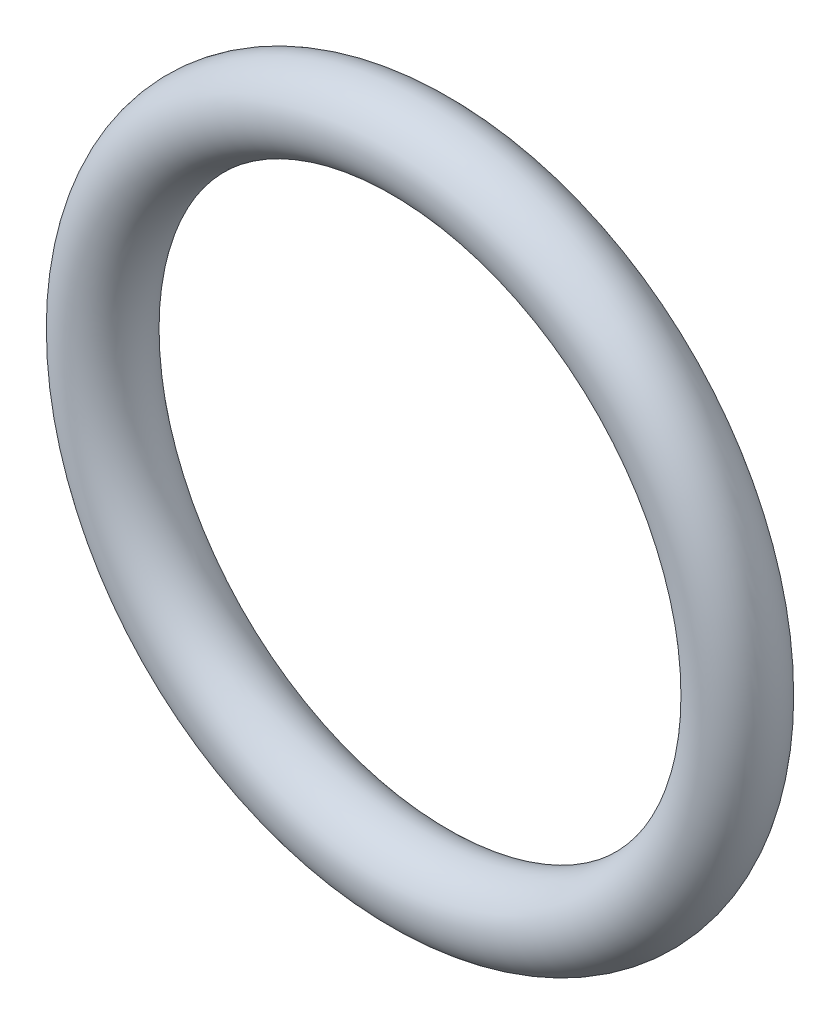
from build123d import *

# Parameters (mm, degrees)
ESQUISSE1_R = 0.575


with BuildPart() as part:
    # Esquisse1 → R_volution1 (revolve)
    with BuildSketch(Plane(origin=(0, 0, 0), x_dir=(0, 0, -1), z_dir=(1, 0, 0)), mode=Mode.PRIVATE) as r_volution1_sk:
        with Locations((0, 4.575)):
            Circle(ESQUISSE1_R)
    revolve(r_volution1_sk.sketch.rotate(Axis((0, 0, 0), (0, 0, -1)), 90), axis=Axis((0, 0, 0), (0, 0, -1)))


solid = part.part
